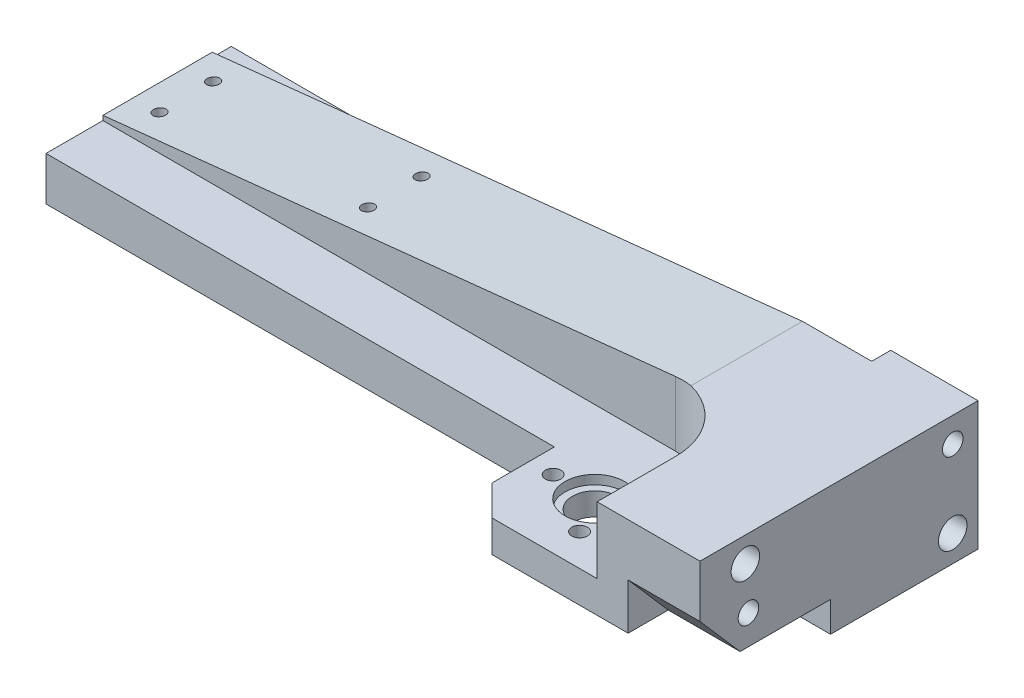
from build123d import *

# Parameters (mm, degrees)
SKETCH1_W                                          = 40.005
SKETCH1_H                                          = 6.35
EXTRUDE1_DEPTH                                     = 11.43
SKETCH4_R                                          = 5.0038
CUT_EXTRUDE2_DEPTH                                 = 1.524
CBORE_FOR_M2_5_PAN_HEAD_MACHINE_SCREW1_D           = 2.6
CBORE_FOR_M2_5_PAN_HEAD_MACHINE_SCREW1_CBORE_D     = 4.6
CBORE_FOR_M2_5_PAN_HEAD_MACHINE_SCREW1_CBORE_DEPTH = 2.5
CIRPATTERN1_COUNT                                  = 3
SKETCH16_R                                         = 3.77063
CUT_EXTRUDE10_DEPTH                                = 42.884784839
SKETCH17_W                                         = 40.005
SKETCH17_H                                         = 6.35
EXTRUDE2_DEPTH                                     = 4.953
SKETCH18_W                                         = 33.02
SKETCH18_H                                         = 5.90169
EXTRUDE3_DEPTH                                     = 5.08
SKETCH20_W                                         = 40.005
SKETCH20_H                                         = 4.206065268
EXTRUDE5_DEPTH                                     = 10.16
SKETCH21_W                                         = 33.02
SKETCH21_H                                         = 21.59
EXTRUDE6_DEPTH                                     = 18.85569
SKETCH24_W                                         = 23.606934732
SKETCH24_H                                         = 10.16
EXTRUDE8_DEPTH                                     = 17.272
F_3_16_0_1875_DIAMETER_HOLE1_D                     = 4.7879
F_3_16_0_1875_DIAMETER_HOLE1_DEPTH                 = 10.16
F_8_32_TAPPED_HOLE1_D                              = 3.4544
F_8_32_TAPPED_HOLE1_DEPTH                          = 13.80744
F_8_32_TAPPED_HOLE1_TIP                            = 1.037806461
SKETCH30_W                                         = 6.985
SKETCH30_H                                         = 16.51
EXTRUDE9_DEPTH                                     = 18.85569
SKETCH31_W                                         = 24.75738
SKETCH31_H                                         = 6.35
EXTRUDE10_DEPTH                                    = 85.344
SKETCH32_W                                         = 22.733
SKETCH32_H                                         = 23.606934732
CUT_EXTRUDE12_DEPTH                                = 1.016
EXTRUDE11_DEPTH                                    = 23.061755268
CUT_EXTRUDE11_DEPTH                                = 12.065
SKETCH36_W                                         = 85.344
SKETCH36_H                                         = 1.695624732
CUT_EXTRUDE13_DEPTH                                = 131.708767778
EXTRUDE12_DEPTH                                    = 1.695624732
CHAMFER1_SIZE                                      = 5.08
M2_5X0_45_TAPPED_HOLE1_D                           = 2.05
M2_5X0_45_TAPPED_HOLE2_D                           = 2.05
M2_5X0_45_TAPPED_HOLE2_DEPTH                       = 9.60501
M2_5X0_45_TAPPED_HOLE2_TIP                         = 0.615882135
SKETCH41_W                                         = 85.471
SKETCH41_H                                         = 7.349000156
EXTRUDE13_DEPTH                                    = 6.35
CUT_EXTRUDE17_DEPTH                                = 3.2004
CUT_EXTRUDE21_DEPTH                                = 3.2004
FILLET3_R                                          = 11.938
FILLET4_R                                          = 5.08
LPATTERN1_COUNT                                    = 4
LPATTERN1_PITCH                                    = 28.448
SKETCH47_R                                         = 5.0038
CUT_EXTRUDE18_DEPTH                                = 1.524
SKETCH48_W                                         = 6.35
SKETCH48_H                                         = 2.015000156
CUT_EXTRUDE19_DEPTH                                = 0.127
CUT_EXTRUDE20_DEPTH                                = 134.163466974


with BuildPart() as part:
    # Sketch1 → Extrude1 (new body)
    with BuildSketch(Plane.XY):
        with Locations((-20.0025, -3.175)):
            Rectangle(SKETCH1_W, SKETCH1_H)
    extrude1 = extrude(amount=EXTRUDE1_DEPTH)

    # Mirror1: Extrude1 across plane
    add(extrude1.mirror(Plane.XY))

    # Sketch4 → Cut-Extrude2 (cut)
    with BuildSketch(Plane(origin=(0, 0, 0), x_dir=(-1, 0, 0), z_dir=(0, 1, 0))):
        with Locations(Location((29.083, 0, 0), (0, 0, 90))):
            Circle(SKETCH4_R)
    extrude(amount=-CUT_EXTRUDE2_DEPTH, mode=Mode.SUBTRACT)

    # CBORE for M2.5 Pan Head Machine Screw1 (through all)
    with Locations(Plane.XZ.offset(6.35)):
        with Locations((-36.08324, 0)):
            cbore_for_m2_5_pan_head_machine_screw1 = CounterBoreHole(CBORE_FOR_M2_5_PAN_HEAD_MACHINE_SCREW1_D / 2, CBORE_FOR_M2_5_PAN_HEAD_MACHINE_SCREW1_CBORE_D / 2, CBORE_FOR_M2_5_PAN_HEAD_MACHINE_SCREW1_CBORE_DEPTH)

    # CirPattern1: CBORE for M2.5 Pan Head Machine Screw1 ×3 about axis
    cirpattern1_axis = Axis((-29.083, 0, 0), (0, 1, 0))
    for i in range(1, CIRPATTERN1_COUNT):
        add(cbore_for_m2_5_pan_head_machine_screw1.rotate(cirpattern1_axis, i * 360 / CIRPATTERN1_COUNT), mode=Mode.SUBTRACT)

    # Sketch16 → Cut-Extrude10 (cut, through all)
    with BuildSketch(Plane(origin=(0, -1.524, 0), x_dir=(-1, 0, 0), z_dir=(0, 1, 0))):
        with Locations(Location((29.083, 0, 0), (0, 0, 90))):
            Circle(SKETCH16_R)
    extrude(amount=-CUT_EXTRUDE10_DEPTH, mode=Mode.SUBTRACT)

    # Sketch17 → Extrude2 (add)
    with BuildSketch(Plane(origin=(0, 0, -11.43), x_dir=(-1, 0, 0), z_dir=(0, 0, -1))):
        with Locations((20.0025, -3.175)):
            Rectangle(SKETCH17_W, SKETCH17_H)
    extrude(amount=EXTRUDE2_DEPTH)

    # Sketch18 → Extrude3 (add)
    with BuildSketch(Plane.XZ.offset(6.35)):
        with Locations((-16.51, -13.432155)):
            Rectangle(SKETCH18_W, SKETCH18_H)
    extrude(amount=EXTRUDE3_DEPTH)

    # Sketch20 → Extrude5 (add)
    with BuildSketch(Plane(origin=(0, 0, 0), x_dir=(-1, 0, 0), z_dir=(0, 1, 0))):
        with Locations((20.0025, -14.279967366)):
            Rectangle(SKETCH20_W, SKETCH20_H)
    extrude(amount=EXTRUDE5_DEPTH)

    # Sketch21 → Extrude6 (add)
    with BuildSketch(Plane(origin=(0, 0, -16.383), x_dir=(-1, 0, 0), z_dir=(0, 0, -1))):
        with Locations((16.51, -0.635)):
            Rectangle(SKETCH21_W, SKETCH21_H)
    extrude(amount=EXTRUDE6_DEPTH)

    # Sketch24 → Extrude8 (add)
    with BuildSketch(Plane(origin=(0, 0, 0), x_dir=(0, 0, -1), z_dir=(1, 0, 0))):
        with Locations((0.373467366, 5.08)):
            Rectangle(SKETCH24_W, SKETCH24_H)
    extrude(amount=-EXTRUDE8_DEPTH)

    # 3_16 _0.1875_ Diameter Hole1
    with Locations(Plane(origin=(0, 0, 0), x_dir=(0, 0, -1), z_dir=(1, 0, 0))):
        with Locations((-3.81381, 5.969), (30.99689, -6.985)):
            Hole(F_3_16_0_1875_DIAMETER_HOLE1_D / 2, depth=F_3_16_0_1875_DIAMETER_HOLE1_DEPTH)

    # 8-32 Tapped Hole1
    with Locations(Plane(origin=(0, 0, 0), x_dir=(0, 0, -1), z_dir=(1, 0, 0))):
        with Locations((30.99689, 5.969), (-3.29311, -1.4224)):
            Hole(F_8_32_TAPPED_HOLE1_D / 2, depth=F_8_32_TAPPED_HOLE1_DEPTH)
            with Locations((0, 0, -(F_8_32_TAPPED_HOLE1_DEPTH + F_8_32_TAPPED_HOLE1_TIP / 2))):  # 118° drill point
                Cone(0, F_8_32_TAPPED_HOLE1_D / 2, F_8_32_TAPPED_HOLE1_TIP, mode=Mode.SUBTRACT)

    # Sketch30 → Extrude9 (add)
    with BuildSketch(Plane(origin=(0, 0, -16.383), x_dir=(-1, 0, 0), z_dir=(0, 0, -1))):
        with Locations((36.5125, 1.905)):
            Rectangle(SKETCH30_W, SKETCH30_H)
    extrude(amount=EXTRUDE9_DEPTH)

    # Sketch31 → Extrude10 (add)
    with BuildSketch(Plane.ZY.offset(40.005)):
        with Locations((-22.86, -3.175)):
            Rectangle(SKETCH31_W, SKETCH31_H)
    extrude(amount=EXTRUDE10_DEPTH)

    # Sketch32 → Cut-Extrude12 (cut)
    with BuildSketch(Plane(origin=(0, 0, 0), x_dir=(-1, 0, 0), z_dir=(0, 1, 0))):
        with Locations((28.6385, -0.373467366)):
            Rectangle(SKETCH32_W, SKETCH32_H)
    extrude(amount=-CUT_EXTRUDE12_DEPTH, mode=Mode.SUBTRACT)

    # Sketch35 → Extrude11 (add)
    with BuildSketch(Plane(origin=(0, 0, -35.23869), x_dir=(-1, 0, 0), z_dir=(0, 0, -1))):
        Polygon((40.005, 10.16), (40.005, 0), (125.349, 0), align=None)
    extrude(amount=-EXTRUDE11_DEPTH)

    # Sketch22 → Cut-Extrude11 (cut)
    with BuildSketch(Plane(origin=(0, 0, 0), x_dir=(0, 0, -1), z_dir=(1, 0, 0))):
        Polygon((-11.43, -6.35), (-4.699, -6.35), (-11.43, 1.393129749), align=None)
    extrude(amount=-CUT_EXTRUDE11_DEPTH, mode=Mode.SUBTRACT)

    # Sketch36 → Cut-Extrude13 (cut, through all)
    with BuildSketch(Plane(origin=(0, 0, 0), x_dir=(-1, 0, 0), z_dir=(0, 1, 0))):
        with Locations((82.677, -11.329122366)):
            Rectangle(SKETCH36_W, SKETCH36_H)
    extrude(amount=-CUT_EXTRUDE13_DEPTH, mode=Mode.SUBTRACT)

    # Sketch38 → Extrude12 (add)
    with BuildSketch(Plane.XY.offset(-12.176934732)):
        Polygon((-40.005, -6.35), (-40.005, -1.016), (-17.272, -1.016), (-17.272, 10.16), (-40.005, 10.16), (-125.349, 0), (-125.349, -6.35), align=None)
    extrude(amount=EXTRUDE12_DEPTH)

    # Chamfer1
    chamfer1_edges = [part.edges().sort_by_distance(p)[0] for p in [
        (-40.005, -3.683, 11.43),
    ]]
    chamfer(chamfer1_edges, length=CHAMFER1_SIZE)

    # M2.5x0.45 Tapped Hole1 (through all)
    with Locations(Plane.XZ.offset(6.35)):
        with Locations((-120.52, -27.36), (-120.52, -18.36), (-85.52, -18.36), (-85.52, -27.36)):
            Hole(M2_5X0_45_TAPPED_HOLE1_D / 2)

    # M2.5x0.45 Tapped Hole2
    with Locations(Plane.XZ.offset(6.35)):
        with Locations((-50.52, -18.36), (-50.52, -27.36)):
            Hole(M2_5X0_45_TAPPED_HOLE2_D / 2, depth=M2_5X0_45_TAPPED_HOLE2_DEPTH)
            with Locations((0, 0, -(M2_5X0_45_TAPPED_HOLE2_DEPTH + M2_5X0_45_TAPPED_HOLE2_TIP / 2))):  # 118° drill point
                Cone(0, M2_5X0_45_TAPPED_HOLE2_D / 2, M2_5X0_45_TAPPED_HOLE2_TIP, mode=Mode.SUBTRACT)

    # Sketch41 → Extrude13 (add)
    with BuildSketch(Plane(origin=(0, 0, -10.48131), x_dir=(-1, 0, 0), z_dir=(0, 0, -1))):
        with Locations((82.6135, -4.690500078)):
            Rectangle(SKETCH41_W, SKETCH41_H)
    extrude(amount=-EXTRUDE13_DEPTH)

    # Sketch44 → Cut-Extrude17 (cut)
    with BuildSketch(Plane(origin=(0, 0, -35.23869), x_dir=(-1, 0, 0), z_dir=(0, 0, -1))):
        Polygon((125.349, 0), (125.349, -1.016), (14.649976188, -1.016), (14.649976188, 10.16), (40.005, 10.16), align=None)
    extrude(amount=-CUT_EXTRUDE17_DEPTH, mode=Mode.SUBTRACT)

    # Sketch50 → Cut-Extrude21 (cut)
    with BuildSketch(Plane.XY.offset(-10.48131)):
        Polygon((-17.272, 10.16), (-17.272, -1.016), (-125.349, -1.016), (-125.349, 0), (-40.005, 10.16), align=None)
    extrude(amount=-CUT_EXTRUDE21_DEPTH, mode=Mode.SUBTRACT)

    # Fillet3
    fillet3_edges = [part.edges().sort_by_distance(p)[0] for p in [
        (-17.272, 4.572, -13.68171),
    ]]
    fillet(fillet3_edges, radius=FILLET3_R)

    # Fillet4
    fillet4_edges = [part.edges().sort_by_distance(p)[0] for p in [
        (-14.649976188, -1.016, -33.63849),
    ]]
    fillet(fillet4_edges, radius=FILLET4_R)

    # Sketch45 → 4-40 Tapped Hole1 (revolve, cut)
    with BuildSketch(Plane(origin=(-117.221, -3.683, -35.23869), x_dir=(0, 1, 0), z_dir=(1, 0, 0))):
        Polygon((0, 0), (0, 8.273752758), (1.1303, 7.5946), (1.1303, 0), align=None)
    f_4_40_tapped_hole1 = revolve(axis=Axis((-117.221, -3.683, -41.58869), (0, 0, 1)), mode=Mode.SUBTRACT)

    # LPattern1: 4-40 Tapped Hole1 ×4
    with Locations(*[(i * LPATTERN1_PITCH, 0, 0) for i in range(1, LPATTERN1_COUNT)]):
        add(f_4_40_tapped_hole1, mode=Mode.SUBTRACT)

    # Sketch47 → Cut-Extrude18 (cut)
    with BuildSketch(Plane(origin=(0, -1.016, 0), x_dir=(-1, 0, 0), z_dir=(0, 1, 0))):
        with Locations(Location((29.083, 0, 0), (0, 0, 90))):
            Circle(SKETCH47_R)
    extrude(amount=-CUT_EXTRUDE18_DEPTH, mode=Mode.SUBTRACT)

    # Sketch48 → Cut-Extrude19 (cut)
    with BuildSketch(Plane(origin=(-39.878, 0, 0), x_dir=(0, 0, -1), z_dir=(1, 0, 0))):
        with Locations((7.30631, -7.357500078)):
            Rectangle(SKETCH48_W, SKETCH48_H)
    extrude(amount=-CUT_EXTRUDE19_DEPTH, mode=Mode.SUBTRACT)

    # Sketch49 → Cut-Extrude20 (cut, through all)
    with BuildSketch(Plane(origin=(0, 0, -32.03829), x_dir=(-1, 0, 0), z_dir=(0, 0, -1))):
        Polygon((26.266408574, 10.16), (125.349, -0.254), (125.349, 10.16), align=None)
    extrude(amount=-CUT_EXTRUDE20_DEPTH, mode=Mode.SUBTRACT)


solid = part.part
